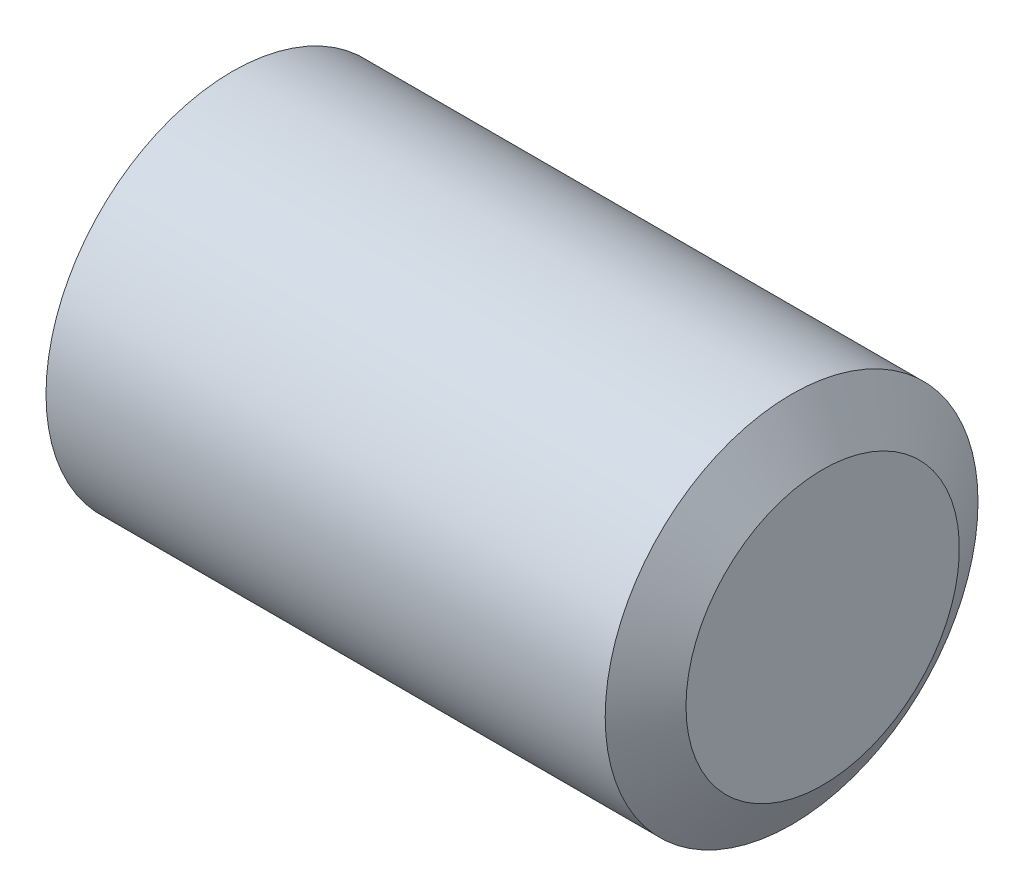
from build123d import *


with BuildPart() as part:
    # Skizze1 → Rotation1 (revolve)
    with BuildSketch(Plane.XY, mode=Mode.PRIVATE) as rotation1_sk:
        Polygon((0, 0), (0, 22), (5, 30), (95, 30), (100, 22), (100, 0), align=None)
    revolve(rotation1_sk.sketch.rotate(Axis((0, 0, 0), (1, 0, 0)), 90), axis=Axis((0, 0, 0), (1, 0, 0)))


solid = part.part
